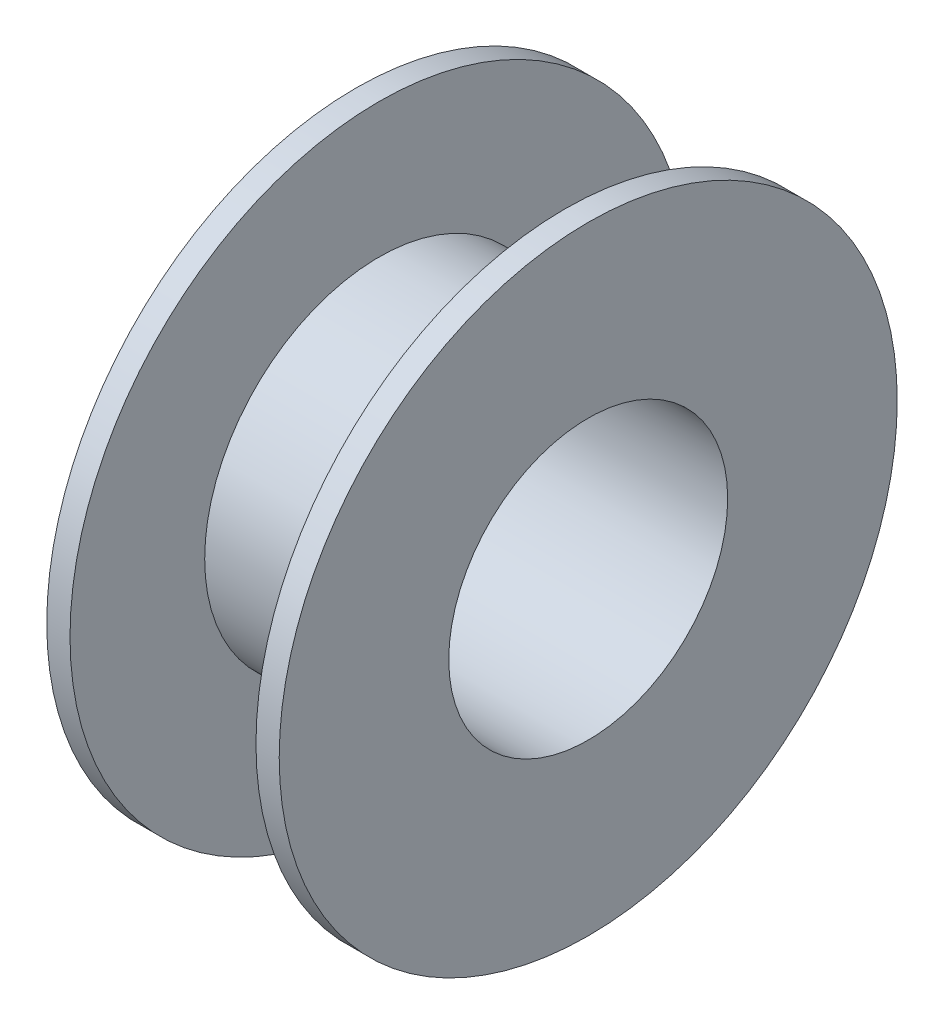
from build123d import *


with BuildPart() as part:
    # Croquis1 → Revoluci_n1 (revolve)
    with BuildSketch(Plane.XY, mode=Mode.PRIVATE) as revoluci_n1_sk:
        Polygon((1, 7.5), (9, 7.5), (9, 13.294117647), (10, 13.294117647), (10, 6), (0, 6), (0, 13.294117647), (1, 13.294117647), align=None)
    revolve(revoluci_n1_sk.sketch.rotate(Axis((0, 0, 0), (1, 0, 0)), 90), axis=Axis((0, 0, 0), (1, 0, 0)))


solid = part.part
